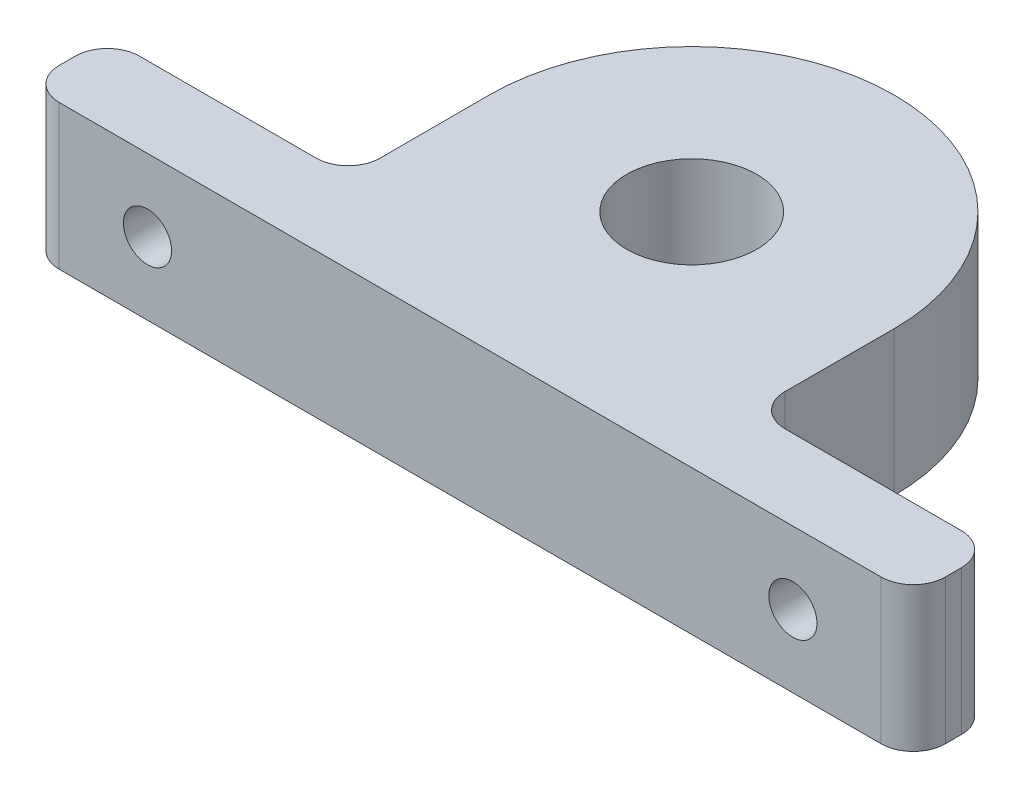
ISO-10303-21;
HEADER;
FILE_DESCRIPTION(('STEP AP214'),'2;1');
FILE_NAME('part.step','',(''),(''),'','','');
FILE_SCHEMA(('AUTOMOTIVE_DESIGN { 1 0 10303 214 1 1 1 1 }'));
ENDSEC;
DATA;
#1=APPLICATION_CONTEXT('core data for automotive mechanical design processes');
#2=APPLICATION_PROTOCOL_DEFINITION('international standard','automotive_design',2000,#1);
#3=PRODUCT_CONTEXT('',#1,'mechanical');
#4=PRODUCT('Part','Part','',(#3));
#5=PRODUCT_RELATED_PRODUCT_CATEGORY('part','',(#4));
#6=PRODUCT_DEFINITION_FORMATION('','',#4);
#7=PRODUCT_DEFINITION_CONTEXT('part definition',#1,'design');
#8=PRODUCT_DEFINITION('design','',#6,#7);
#9=PRODUCT_DEFINITION_SHAPE('','',#8);
#10=(LENGTH_UNIT() NAMED_UNIT(*) SI_UNIT(.MILLI.,.METRE.));
#11=(NAMED_UNIT(*) PLANE_ANGLE_UNIT() SI_UNIT($,.RADIAN.));
#12=(NAMED_UNIT(*) SI_UNIT($,.STERADIAN.) SOLID_ANGLE_UNIT());
#13=UNCERTAINTY_MEASURE_WITH_UNIT(LENGTH_MEASURE(1.E-05),#10,'distance_accuracy_value','');
#14=(GEOMETRIC_REPRESENTATION_CONTEXT(3) GLOBAL_UNCERTAINTY_ASSIGNED_CONTEXT((#13)) GLOBAL_UNIT_ASSIGNED_CONTEXT((#10,
#11,#12)) REPRESENTATION_CONTEXT('',''));
#15=CARTESIAN_POINT('',(0.,0.,0.));
#16=DIRECTION('',(0.,0.,1.));
#17=DIRECTION('',(1.,0.,0.));
#18=AXIS2_PLACEMENT_3D('',#15,#16,#17);
#19=CARTESIAN_POINT('',(-27.6,9.,0.));
#20=DIRECTION('',(-1.,0.,0.));
#21=DIRECTION('',(0.,0.,1.));
#22=AXIS2_PLACEMENT_3D('',#19,#20,#21);
#23=PLANE('',#22);
#24=DIRECTION('',(0.,0.,-1.));
#25=VECTOR('',#24,1.);
#26=CARTESIAN_POINT('',(-27.6,0.,0.));
#27=LINE('',#26,#25);
#28=CARTESIAN_POINT('',(-27.6,0.,11.8));
#29=VERTEX_POINT('',#28);
#30=CARTESIAN_POINT('',(-27.6,0.,10.8));
#31=VERTEX_POINT('',#30);
#32=EDGE_CURVE('E175',#29,#31,#27,.T.);
#33=ORIENTED_EDGE('',*,*,#32,.F.);
#34=DIRECTION('',(0.,-1.,0.));
#35=VECTOR('',#34,1.);
#36=CARTESIAN_POINT('',(-27.6,9.,11.8));
#37=LINE('',#36,#35);
#38=CARTESIAN_POINT('',(-27.6,9.,11.8));
#39=VERTEX_POINT('',#38);
#40=EDGE_CURVE('E227',#29,#39,#37,.F.);
#41=ORIENTED_EDGE('',*,*,#40,.T.);
#42=DIRECTION('',(0.,0.,-1.));
#43=VECTOR('',#42,1.);
#44=CARTESIAN_POINT('',(-27.6,9.,0.));
#45=LINE('',#44,#43);
#46=CARTESIAN_POINT('',(-27.6,9.,10.8));
#47=VERTEX_POINT('',#46);
#48=EDGE_CURVE('E262',#39,#47,#45,.T.);
#49=ORIENTED_EDGE('',*,*,#48,.T.);
#50=DIRECTION('',(0.,-1.,0.));
#51=VECTOR('',#50,1.);
#52=CARTESIAN_POINT('',(-27.6,9.,10.8));
#53=LINE('',#52,#51);
#54=EDGE_CURVE('E224',#47,#31,#53,.T.);
#55=ORIENTED_EDGE('',*,*,#54,.T.);
#56=EDGE_LOOP('',(#33,#41,#49,#55));
#57=FACE_BOUND('',#56,.T.);
#58=ADVANCED_FACE('F35',(#57),#23,.T.);
#59=CARTESIAN_POINT('',(0.,9.,13.8));
#60=DIRECTION('',(0.,0.,-1.));
#61=DIRECTION('',(-1.,0.,0.));
#62=AXIS2_PLACEMENT_3D('',#59,#60,#61);
#63=PLANE('',#62);
#64=CARTESIAN_POINT('',(20.1011886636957,4.5,13.8));
#65=DIRECTION('',(0.,0.,-1.));
#66=DIRECTION('',(-1.,0.,0.));
#67=AXIS2_PLACEMENT_3D('',#64,#65,#66);
#68=CIRCLE('',#67,1.5);
#69=CARTESIAN_POINT('',(18.6011886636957,4.5,13.8));
#70=VERTEX_POINT('',#69);
#71=EDGE_CURVE('E285',#70,#70,#68,.T.);
#72=ORIENTED_EDGE('',*,*,#71,.T.);
#73=EDGE_LOOP('',(#72));
#74=FACE_BOUND('',#73,.T.);
#75=CARTESIAN_POINT('',(-20.1011886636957,4.5,13.8));
#76=DIRECTION('',(0.,0.,-1.));
#77=DIRECTION('',(-1.,0.,0.));
#78=AXIS2_PLACEMENT_3D('',#75,#76,#77);
#79=CIRCLE('',#78,1.5);
#80=CARTESIAN_POINT('',(-21.6011886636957,4.5,13.8));
#81=VERTEX_POINT('',#80);
#82=EDGE_CURVE('E176',#81,#81,#79,.T.);
#83=ORIENTED_EDGE('',*,*,#82,.T.);
#84=EDGE_LOOP('',(#83));
#85=FACE_BOUND('',#84,.T.);
#86=DIRECTION('',(1.,0.,0.));
#87=VECTOR('',#86,1.);
#88=CARTESIAN_POINT('',(0.,0.,13.8));
#89=LINE('',#88,#87);
#90=CARTESIAN_POINT('',(-25.6,0.,13.8));
#91=VERTEX_POINT('',#90);
#92=CARTESIAN_POINT('',(25.6,0.,13.8));
#93=VERTEX_POINT('',#92);
#94=EDGE_CURVE('E179',#91,#93,#89,.T.);
#95=ORIENTED_EDGE('',*,*,#94,.T.);
#96=DIRECTION('',(0.,-1.,0.));
#97=VECTOR('',#96,1.);
#98=CARTESIAN_POINT('',(25.6,9.,13.8));
#99=LINE('',#98,#97);
#100=CARTESIAN_POINT('',(25.6,9.,13.8));
#101=VERTEX_POINT('',#100);
#102=EDGE_CURVE('E214',#93,#101,#99,.F.);
#103=ORIENTED_EDGE('',*,*,#102,.T.);
#104=DIRECTION('',(1.,0.,0.));
#105=VECTOR('',#104,1.);
#106=CARTESIAN_POINT('',(0.,9.,13.8));
#107=LINE('',#106,#105);
#108=CARTESIAN_POINT('',(-25.6,9.,13.8));
#109=VERTEX_POINT('',#108);
#110=EDGE_CURVE('E272',#109,#101,#107,.T.);
#111=ORIENTED_EDGE('',*,*,#110,.F.);
#112=DIRECTION('',(0.,-1.,0.));
#113=VECTOR('',#112,1.);
#114=CARTESIAN_POINT('',(-25.6,0.,13.8));
#115=LINE('',#114,#113);
#116=EDGE_CURVE('E211',#109,#91,#115,.T.);
#117=ORIENTED_EDGE('',*,*,#116,.T.);
#118=EDGE_LOOP('',(#95,#103,#111,#117));
#119=FACE_BOUND('',#118,.T.);
#120=ADVANCED_FACE('F270',(#74,#85,#119),#63,.F.);
#121=CARTESIAN_POINT('',(27.6,9.,0.));
#122=DIRECTION('',(-1.,0.,0.));
#123=DIRECTION('',(0.,0.,1.));
#124=AXIS2_PLACEMENT_3D('',#121,#122,#123);
#125=PLANE('',#124);
#126=DIRECTION('',(0.,0.,-1.));
#127=VECTOR('',#126,1.);
#128=CARTESIAN_POINT('',(27.6,9.,0.));
#129=LINE('',#128,#127);
#130=CARTESIAN_POINT('',(27.6,9.,11.8));
#131=VERTEX_POINT('',#130);
#132=CARTESIAN_POINT('',(27.6,9.,10.8));
#133=VERTEX_POINT('',#132);
#134=EDGE_CURVE('E165',#131,#133,#129,.T.);
#135=ORIENTED_EDGE('',*,*,#134,.F.);
#136=DIRECTION('',(0.,-1.,0.));
#137=VECTOR('',#136,1.);
#138=CARTESIAN_POINT('',(27.6,9.,11.8));
#139=LINE('',#138,#137);
#140=CARTESIAN_POINT('',(27.6,0.,11.8));
#141=VERTEX_POINT('',#140);
#142=EDGE_CURVE('E200',#131,#141,#139,.T.);
#143=ORIENTED_EDGE('',*,*,#142,.T.);
#144=DIRECTION('',(0.,0.,-1.));
#145=VECTOR('',#144,1.);
#146=CARTESIAN_POINT('',(27.6,0.,0.));
#147=LINE('',#146,#145);
#148=CARTESIAN_POINT('',(27.6,0.,10.8));
#149=VERTEX_POINT('',#148);
#150=EDGE_CURVE('E182',#141,#149,#147,.T.);
#151=ORIENTED_EDGE('',*,*,#150,.T.);
#152=DIRECTION('',(0.,-1.,0.));
#153=VECTOR('',#152,1.);
#154=CARTESIAN_POINT('',(27.6,9.,10.8));
#155=LINE('',#154,#153);
#156=EDGE_CURVE('E148',#149,#133,#155,.F.);
#157=ORIENTED_EDGE('',*,*,#156,.T.);
#158=EDGE_LOOP('',(#135,#143,#151,#157));
#159=FACE_BOUND('',#158,.T.);
#160=ADVANCED_FACE('F298',(#159),#125,.F.);
#161=CARTESIAN_POINT('',(0.,9.,8.80000000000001));
#162=DIRECTION('',(0.,0.,1.));
#163=DIRECTION('',(1.,0.,0.));
#164=AXIS2_PLACEMENT_3D('',#161,#162,#163);
#165=PLANE('',#164);
#166=CARTESIAN_POINT('',(20.1011886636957,4.5,8.80000000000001));
#167=DIRECTION('',(0.,0.,-1.));
#168=DIRECTION('',(1.,0.,0.));
#169=AXIS2_PLACEMENT_3D('',#166,#167,#168);
#170=CIRCLE('',#169,1.5);
#171=CARTESIAN_POINT('',(21.6011886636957,4.5,8.80000000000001));
#172=VERTEX_POINT('',#171);
#173=EDGE_CURVE('E288',#172,#172,#170,.T.);
#174=ORIENTED_EDGE('',*,*,#173,.F.);
#175=EDGE_LOOP('',(#174));
#176=FACE_BOUND('',#175,.T.);
#177=DIRECTION('',(-1.,0.,0.));
#178=VECTOR('',#177,1.);
#179=CARTESIAN_POINT('',(0.,9.,8.80000000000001));
#180=LINE('',#179,#178);
#181=CARTESIAN_POINT('',(25.6,9.,8.8));
#182=VERTEX_POINT('',#181);
#183=CARTESIAN_POINT('',(14.6023773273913,9.,8.80000000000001));
#184=VERTEX_POINT('',#183);
#185=EDGE_CURVE('E163',#182,#184,#180,.T.);
#186=ORIENTED_EDGE('',*,*,#185,.F.);
#187=DIRECTION('',(0.,-1.,0.));
#188=VECTOR('',#187,1.);
#189=CARTESIAN_POINT('',(25.6,9.,8.8));
#190=LINE('',#189,#188);
#191=CARTESIAN_POINT('',(25.6,0.,8.8));
#192=VERTEX_POINT('',#191);
#193=EDGE_CURVE('E235',#182,#192,#190,.T.);
#194=ORIENTED_EDGE('',*,*,#193,.T.);
#195=DIRECTION('',(-1.,0.,0.));
#196=VECTOR('',#195,1.);
#197=CARTESIAN_POINT('',(0.,0.,8.80000000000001));
#198=LINE('',#197,#196);
#199=CARTESIAN_POINT('',(14.6023773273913,0.,8.80000000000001));
#200=VERTEX_POINT('',#199);
#201=EDGE_CURVE('E185',#192,#200,#198,.T.);
#202=ORIENTED_EDGE('',*,*,#201,.T.);
#203=DIRECTION('',(0.,-1.,0.));
#204=VECTOR('',#203,1.);
#205=CARTESIAN_POINT('',(14.6023773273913,9.,8.80000000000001));
#206=LINE('',#205,#204);
#207=EDGE_CURVE('E233',#200,#184,#206,.F.);
#208=ORIENTED_EDGE('',*,*,#207,.T.);
#209=EDGE_LOOP('',(#186,#194,#202,#208));
#210=FACE_BOUND('',#209,.T.);
#211=ADVANCED_FACE('F295',(#176,#210),#165,.F.);
#212=CARTESIAN_POINT('',(12.6104362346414,9.,0.0149806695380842));
#213=DIRECTION('',(0.999999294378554,0.,0.00118795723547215));
#214=DIRECTION('',(0.00118795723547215,0.,-0.999999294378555));
#215=AXIS2_PLACEMENT_3D('',#212,#213,#214);
#216=PLANE('',#215);
#217=DIRECTION('',(-0.00118795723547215,0.,0.999999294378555));
#218=VECTOR('',#217,1.);
#219=CARTESIAN_POINT('',(12.6104362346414,9.,0.0149806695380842));
#220=LINE('',#219,#218);
#221=CARTESIAN_POINT('',(12.6104540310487,9.,0.));
#222=VERTEX_POINT('',#221);
#223=CARTESIAN_POINT('',(12.6023787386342,9.,6.79762408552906));
#224=VERTEX_POINT('',#223);
#225=EDGE_CURVE('E141',#222,#224,#220,.T.);
#226=ORIENTED_EDGE('',*,*,#225,.T.);
#227=DIRECTION('',(0.,-1.,0.));
#228=VECTOR('',#227,1.);
#229=CARTESIAN_POINT('',(12.6023787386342,9.,6.79762408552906));
#230=LINE('',#229,#228);
#231=CARTESIAN_POINT('',(12.6023787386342,0.,6.79762408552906));
#232=VERTEX_POINT('',#231);
#233=EDGE_CURVE('E238',#224,#232,#230,.T.);
#234=ORIENTED_EDGE('',*,*,#233,.T.);
#235=DIRECTION('',(-0.00118795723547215,0.,0.999999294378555));
#236=VECTOR('',#235,1.);
#237=CARTESIAN_POINT('',(12.6104362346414,0.,0.0149806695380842));
#238=LINE('',#237,#236);
#239=CARTESIAN_POINT('',(12.6104540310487,0.,0.));
#240=VERTEX_POINT('',#239);
#241=EDGE_CURVE('E144',#240,#232,#238,.T.);
#242=ORIENTED_EDGE('',*,*,#241,.F.);
#243=DIRECTION('',(0.,-1.,0.));
#244=VECTOR('',#243,1.);
#245=CARTESIAN_POINT('',(12.6104540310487,9.,0.));
#246=LINE('',#245,#244);
#247=EDGE_CURVE('E136',#222,#240,#246,.T.);
#248=ORIENTED_EDGE('',*,*,#247,.F.);
#249=EDGE_LOOP('',(#226,#234,#242,#248));
#250=FACE_BOUND('',#249,.T.);
#251=ADVANCED_FACE('F138',(#250),#216,.T.);
#252=CARTESIAN_POINT('',(0.,9.,0.));
#253=DIRECTION('',(0.,-1.,0.));
#254=DIRECTION('',(0.,0.,-1.));
#255=AXIS2_PLACEMENT_3D('',#252,#253,#254);
#256=CYLINDRICAL_SURFACE('',#255,12.6104540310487);
#257=CARTESIAN_POINT('',(0.,0.,0.));
#258=DIRECTION('',(0.,1.,0.));
#259=DIRECTION('',(0.,0.,1.));
#260=AXIS2_PLACEMENT_3D('',#257,#258,#259);
#261=CIRCLE('',#260,12.6104540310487);
#262=CARTESIAN_POINT('',(-12.6104540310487,0.,0.));
#263=VERTEX_POINT('',#262);
#264=EDGE_CURVE('E189',#240,#263,#261,.T.);
#265=ORIENTED_EDGE('',*,*,#264,.T.);
#266=DIRECTION('',(0.,-1.,0.));
#267=VECTOR('',#266,1.);
#268=CARTESIAN_POINT('',(-12.6104540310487,9.,0.));
#269=LINE('',#268,#267);
#270=CARTESIAN_POINT('',(-12.6104540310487,9.,0.));
#271=VERTEX_POINT('',#270);
#272=EDGE_CURVE('E149',#271,#263,#269,.T.);
#273=ORIENTED_EDGE('',*,*,#272,.F.);
#274=CARTESIAN_POINT('',(0.,9.,0.));
#275=DIRECTION('',(0.,1.,0.));
#276=DIRECTION('',(0.,0.,1.));
#277=AXIS2_PLACEMENT_3D('',#274,#275,#276);
#278=CIRCLE('',#277,12.6104540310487);
#279=EDGE_CURVE('E153',#222,#271,#278,.T.);
#280=ORIENTED_EDGE('',*,*,#279,.F.);
#281=ORIENTED_EDGE('',*,*,#247,.T.);
#282=EDGE_LOOP('',(#265,#273,#280,#281));
#283=FACE_BOUND('',#282,.T.);
#284=ADVANCED_FACE('F154',(#283),#256,.T.);
#285=CARTESIAN_POINT('',(-12.6104362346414,9.,0.0149806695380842));
#286=DIRECTION('',(0.999999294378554,0.,-0.00118795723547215));
#287=DIRECTION('',(-0.00118795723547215,0.,-0.999999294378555));
#288=AXIS2_PLACEMENT_3D('',#285,#286,#287);
#289=PLANE('',#288);
#290=DIRECTION('',(0.00118795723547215,0.,0.999999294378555));
#291=VECTOR('',#290,1.);
#292=CARTESIAN_POINT('',(-12.6104362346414,0.,0.0149806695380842));
#293=LINE('',#292,#291);
#294=CARTESIAN_POINT('',(-12.6023787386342,0.,6.79762408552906));
#295=VERTEX_POINT('',#294);
#296=EDGE_CURVE('E191',#263,#295,#293,.T.);
#297=ORIENTED_EDGE('',*,*,#296,.T.);
#298=DIRECTION('',(0.,-1.,0.));
#299=VECTOR('',#298,1.);
#300=CARTESIAN_POINT('',(-12.6023787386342,9.,6.79762408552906));
#301=LINE('',#300,#299);
#302=CARTESIAN_POINT('',(-12.6023787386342,9.,6.79762408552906));
#303=VERTEX_POINT('',#302);
#304=EDGE_CURVE('E240',#295,#303,#301,.F.);
#305=ORIENTED_EDGE('',*,*,#304,.T.);
#306=DIRECTION('',(0.00118795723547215,0.,0.999999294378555));
#307=VECTOR('',#306,1.);
#308=CARTESIAN_POINT('',(-12.6104362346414,9.,0.0149806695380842));
#309=LINE('',#308,#307);
#310=EDGE_CURVE('E156',#271,#303,#309,.T.);
#311=ORIENTED_EDGE('',*,*,#310,.F.);
#312=ORIENTED_EDGE('',*,*,#272,.T.);
#313=EDGE_LOOP('',(#297,#305,#311,#312));
#314=FACE_BOUND('',#313,.T.);
#315=ADVANCED_FACE('F251',(#314),#289,.F.);
#316=CARTESIAN_POINT('',(0.,9.,0.));
#317=DIRECTION('',(0.,-1.,0.));
#318=DIRECTION('',(0.,0.,-1.));
#319=AXIS2_PLACEMENT_3D('',#316,#317,#318);
#320=CYLINDRICAL_SURFACE('',#319,4.05);
#321=CARTESIAN_POINT('',(0.,9.,0.));
#322=DIRECTION('',(0.,1.,0.));
#323=DIRECTION('',(0.,0.,1.));
#324=AXIS2_PLACEMENT_3D('',#321,#322,#323);
#325=CIRCLE('',#324,4.05);
#326=CARTESIAN_POINT('',(0.,9.,4.05));
#327=VERTEX_POINT('',#326);
#328=EDGE_CURVE('E197',#327,#327,#325,.T.);
#329=ORIENTED_EDGE('',*,*,#328,.T.);
#330=EDGE_LOOP('',(#329));
#331=FACE_BOUND('',#330,.T.);
#332=CARTESIAN_POINT('',(0.,0.,0.));
#333=DIRECTION('',(0.,1.,0.));
#334=DIRECTION('',(0.,0.,1.));
#335=AXIS2_PLACEMENT_3D('',#332,#333,#334);
#336=CIRCLE('',#335,4.05);
#337=CARTESIAN_POINT('',(0.,0.,4.05));
#338=VERTEX_POINT('',#337);
#339=EDGE_CURVE('E172',#338,#338,#336,.T.);
#340=ORIENTED_EDGE('',*,*,#339,.F.);
#341=EDGE_LOOP('',(#340));
#342=FACE_BOUND('',#341,.T.);
#343=ADVANCED_FACE('F332',(#331,#342),#320,.F.);
#344=CARTESIAN_POINT('',(0.,9.,8.80000000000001));
#345=DIRECTION('',(0.,0.,-1.));
#346=DIRECTION('',(-1.,0.,0.));
#347=AXIS2_PLACEMENT_3D('',#344,#345,#346);
#348=PLANE('',#347);
#349=CARTESIAN_POINT('',(-20.1011886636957,4.5,8.8));
#350=DIRECTION('',(0.,0.,-1.));
#351=DIRECTION('',(-1.,0.,0.));
#352=AXIS2_PLACEMENT_3D('',#349,#350,#351);
#353=CIRCLE('',#352,1.5);
#354=CARTESIAN_POINT('',(-21.6011886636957,4.5,8.8));
#355=VERTEX_POINT('',#354);
#356=EDGE_CURVE('E282',#355,#355,#353,.T.);
#357=ORIENTED_EDGE('',*,*,#356,.F.);
#358=EDGE_LOOP('',(#357));
#359=FACE_BOUND('',#358,.T.);
#360=DIRECTION('',(1.,0.,0.));
#361=VECTOR('',#360,1.);
#362=CARTESIAN_POINT('',(0.,0.,8.80000000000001));
#363=LINE('',#362,#361);
#364=CARTESIAN_POINT('',(-25.6,0.,8.8));
#365=VERTEX_POINT('',#364);
#366=CARTESIAN_POINT('',(-14.6023773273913,0.,8.80000000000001));
#367=VERTEX_POINT('',#366);
#368=EDGE_CURVE('E194',#365,#367,#363,.T.);
#369=ORIENTED_EDGE('',*,*,#368,.F.);
#370=DIRECTION('',(0.,-1.,0.));
#371=VECTOR('',#370,1.);
#372=CARTESIAN_POINT('',(-25.6,9.,8.8));
#373=LINE('',#372,#371);
#374=CARTESIAN_POINT('',(-25.6,9.,8.8));
#375=VERTEX_POINT('',#374);
#376=EDGE_CURVE('E55',#365,#375,#373,.F.);
#377=ORIENTED_EDGE('',*,*,#376,.T.);
#378=DIRECTION('',(1.,0.,0.));
#379=VECTOR('',#378,1.);
#380=CARTESIAN_POINT('',(0.,9.,8.80000000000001));
#381=LINE('',#380,#379);
#382=CARTESIAN_POINT('',(-14.6023773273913,9.,8.80000000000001));
#383=VERTEX_POINT('',#382);
#384=EDGE_CURVE('E170',#375,#383,#381,.T.);
#385=ORIENTED_EDGE('',*,*,#384,.T.);
#386=DIRECTION('',(0.,-1.,0.));
#387=VECTOR('',#386,1.);
#388=CARTESIAN_POINT('',(-14.6023773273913,9.,8.80000000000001));
#389=LINE('',#388,#387);
#390=EDGE_CURVE('E229',#383,#367,#389,.T.);
#391=ORIENTED_EDGE('',*,*,#390,.T.);
#392=EDGE_LOOP('',(#369,#377,#385,#391));
#393=FACE_BOUND('',#392,.T.);
#394=ADVANCED_FACE('F252',(#359,#393),#348,.T.);
#395=CARTESIAN_POINT('',(0.,9.,0.));
#396=DIRECTION('',(0.,1.,0.));
#397=DIRECTION('',(0.,0.,1.));
#398=AXIS2_PLACEMENT_3D('',#395,#396,#397);
#399=PLANE('',#398);
#400=ORIENTED_EDGE('',*,*,#328,.F.);
#401=EDGE_LOOP('',(#400));
#402=FACE_BOUND('',#401,.T.);
#403=ORIENTED_EDGE('',*,*,#110,.T.);
#404=CARTESIAN_POINT('',(25.6,9.,11.8));
#405=DIRECTION('',(0.,1.,0.));
#406=DIRECTION('',(0.,0.,1.));
#407=AXIS2_PLACEMENT_3D('',#404,#405,#406);
#408=CIRCLE('',#407,2.);
#409=EDGE_CURVE('E222',#101,#131,#408,.T.);
#410=ORIENTED_EDGE('',*,*,#409,.T.);
#411=ORIENTED_EDGE('',*,*,#134,.T.);
#412=CARTESIAN_POINT('',(25.6,9.,10.8));
#413=DIRECTION('',(0.,1.,0.));
#414=DIRECTION('',(0.,0.,1.));
#415=AXIS2_PLACEMENT_3D('',#412,#413,#414);
#416=CIRCLE('',#415,2.);
#417=EDGE_CURVE('E216',#133,#182,#416,.T.);
#418=ORIENTED_EDGE('',*,*,#417,.T.);
#419=ORIENTED_EDGE('',*,*,#185,.T.);
#420=CARTESIAN_POINT('',(14.6023773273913,9.,6.80000000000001));
#421=DIRECTION('',(0.,1.,0.));
#422=DIRECTION('',(0.,0.,1.));
#423=AXIS2_PLACEMENT_3D('',#420,#421,#422);
#424=CIRCLE('',#423,2.);
#425=EDGE_CURVE('E162',#184,#224,#424,.F.);
#426=ORIENTED_EDGE('',*,*,#425,.T.);
#427=ORIENTED_EDGE('',*,*,#225,.F.);
#428=ORIENTED_EDGE('',*,*,#279,.T.);
#429=ORIENTED_EDGE('',*,*,#310,.T.);
#430=CARTESIAN_POINT('',(-14.6023773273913,9.,6.80000000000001));
#431=DIRECTION('',(0.,1.,0.));
#432=DIRECTION('',(0.,0.,1.));
#433=AXIS2_PLACEMENT_3D('',#430,#431,#432);
#434=CIRCLE('',#433,2.);
#435=EDGE_CURVE('E11',#303,#383,#434,.F.);
#436=ORIENTED_EDGE('',*,*,#435,.T.);
#437=ORIENTED_EDGE('',*,*,#384,.F.);
#438=CARTESIAN_POINT('',(-25.6,9.,10.8));
#439=DIRECTION('',(0.,1.,0.));
#440=DIRECTION('',(0.,0.,1.));
#441=AXIS2_PLACEMENT_3D('',#438,#439,#440);
#442=CIRCLE('',#441,2.);
#443=EDGE_CURVE('E218',#375,#47,#442,.T.);
#444=ORIENTED_EDGE('',*,*,#443,.T.);
#445=ORIENTED_EDGE('',*,*,#48,.F.);
#446=CARTESIAN_POINT('',(-25.6,9.,11.8));
#447=DIRECTION('',(0.,1.,0.));
#448=DIRECTION('',(0.,0.,1.));
#449=AXIS2_PLACEMENT_3D('',#446,#447,#448);
#450=CIRCLE('',#449,2.);
#451=EDGE_CURVE('E220',#39,#109,#450,.T.);
#452=ORIENTED_EDGE('',*,*,#451,.T.);
#453=EDGE_LOOP('',(#403,#410,#411,#418,#419,#426,#427,#428,#429,#436,#437,#444,#445,#452));
#454=FACE_BOUND('',#453,.T.);
#455=ADVANCED_FACE('F159',(#402,#454),#399,.T.);
#456=CARTESIAN_POINT('',(0.,0.,0.));
#457=DIRECTION('',(0.,1.,0.));
#458=DIRECTION('',(0.,0.,1.));
#459=AXIS2_PLACEMENT_3D('',#456,#457,#458);
#460=PLANE('',#459);
#461=ORIENTED_EDGE('',*,*,#339,.T.);
#462=EDGE_LOOP('',(#461));
#463=FACE_BOUND('',#462,.T.);
#464=ORIENTED_EDGE('',*,*,#150,.F.);
#465=CARTESIAN_POINT('',(25.6,0.,11.8));
#466=DIRECTION('',(0.,1.,0.));
#467=DIRECTION('',(0.,0.,1.));
#468=AXIS2_PLACEMENT_3D('',#465,#466,#467);
#469=CIRCLE('',#468,2.);
#470=EDGE_CURVE('E209',#141,#93,#469,.F.);
#471=ORIENTED_EDGE('',*,*,#470,.T.);
#472=ORIENTED_EDGE('',*,*,#94,.F.);
#473=CARTESIAN_POINT('',(-25.6,0.,11.8));
#474=DIRECTION('',(0.,1.,0.));
#475=DIRECTION('',(0.,0.,1.));
#476=AXIS2_PLACEMENT_3D('',#473,#474,#475);
#477=CIRCLE('',#476,2.);
#478=EDGE_CURVE('E207',#91,#29,#477,.F.);
#479=ORIENTED_EDGE('',*,*,#478,.T.);
#480=ORIENTED_EDGE('',*,*,#32,.T.);
#481=CARTESIAN_POINT('',(-25.6,0.,10.8));
#482=DIRECTION('',(0.,1.,0.));
#483=DIRECTION('',(0.,0.,1.));
#484=AXIS2_PLACEMENT_3D('',#481,#482,#483);
#485=CIRCLE('',#484,2.);
#486=EDGE_CURVE('E205',#31,#365,#485,.F.);
#487=ORIENTED_EDGE('',*,*,#486,.T.);
#488=ORIENTED_EDGE('',*,*,#368,.T.);
#489=CARTESIAN_POINT('',(-14.6023773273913,0.,6.80000000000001));
#490=DIRECTION('',(0.,1.,0.));
#491=DIRECTION('',(0.,0.,1.));
#492=AXIS2_PLACEMENT_3D('',#489,#490,#491);
#493=CIRCLE('',#492,2.);
#494=EDGE_CURVE('E43',#367,#295,#493,.T.);
#495=ORIENTED_EDGE('',*,*,#494,.T.);
#496=ORIENTED_EDGE('',*,*,#296,.F.);
#497=ORIENTED_EDGE('',*,*,#264,.F.);
#498=ORIENTED_EDGE('',*,*,#241,.T.);
#499=CARTESIAN_POINT('',(14.6023773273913,0.,6.80000000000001));
#500=DIRECTION('',(0.,1.,0.));
#501=DIRECTION('',(0.,0.,1.));
#502=AXIS2_PLACEMENT_3D('',#499,#500,#501);
#503=CIRCLE('',#502,2.);
#504=EDGE_CURVE('E242',#232,#200,#503,.T.);
#505=ORIENTED_EDGE('',*,*,#504,.T.);
#506=ORIENTED_EDGE('',*,*,#201,.F.);
#507=CARTESIAN_POINT('',(25.6,0.,10.8));
#508=DIRECTION('',(0.,1.,0.));
#509=DIRECTION('',(0.,0.,1.));
#510=AXIS2_PLACEMENT_3D('',#507,#508,#509);
#511=CIRCLE('',#510,2.);
#512=EDGE_CURVE('E203',#192,#149,#511,.F.);
#513=ORIENTED_EDGE('',*,*,#512,.T.);
#514=EDGE_LOOP('',(#464,#471,#472,#479,#480,#487,#488,#495,#496,#497,#498,#505,#506,#513));
#515=FACE_BOUND('',#514,.T.);
#516=ADVANCED_FACE('F246',(#463,#515),#460,.F.);
#517=CARTESIAN_POINT('',(25.6,9.,11.8));
#518=DIRECTION('',(0.,-1.,0.));
#519=DIRECTION('',(0.,0.,-1.));
#520=AXIS2_PLACEMENT_3D('',#517,#518,#519);
#521=CYLINDRICAL_SURFACE('',#520,2.);
#522=ORIENTED_EDGE('',*,*,#409,.F.);
#523=ORIENTED_EDGE('',*,*,#102,.F.);
#524=ORIENTED_EDGE('',*,*,#470,.F.);
#525=ORIENTED_EDGE('',*,*,#142,.F.);
#526=EDGE_LOOP('',(#522,#523,#524,#525));
#527=FACE_BOUND('',#526,.T.);
#528=ADVANCED_FACE('F312',(#527),#521,.T.);
#529=CARTESIAN_POINT('',(-25.6,9.,11.8));
#530=DIRECTION('',(0.,1.,0.));
#531=DIRECTION('',(0.,0.,1.));
#532=AXIS2_PLACEMENT_3D('',#529,#530,#531);
#533=CYLINDRICAL_SURFACE('',#532,2.);
#534=ORIENTED_EDGE('',*,*,#451,.F.);
#535=ORIENTED_EDGE('',*,*,#40,.F.);
#536=ORIENTED_EDGE('',*,*,#478,.F.);
#537=ORIENTED_EDGE('',*,*,#116,.F.);
#538=EDGE_LOOP('',(#534,#535,#536,#537));
#539=FACE_BOUND('',#538,.T.);
#540=ADVANCED_FACE('F267',(#539),#533,.T.);
#541=CARTESIAN_POINT('',(-25.6,9.,10.8));
#542=DIRECTION('',(0.,-1.,0.));
#543=DIRECTION('',(0.,0.,-1.));
#544=AXIS2_PLACEMENT_3D('',#541,#542,#543);
#545=CYLINDRICAL_SURFACE('',#544,2.);
#546=ORIENTED_EDGE('',*,*,#443,.F.);
#547=ORIENTED_EDGE('',*,*,#376,.F.);
#548=ORIENTED_EDGE('',*,*,#486,.F.);
#549=ORIENTED_EDGE('',*,*,#54,.F.);
#550=EDGE_LOOP('',(#546,#547,#548,#549));
#551=FACE_BOUND('',#550,.T.);
#552=ADVANCED_FACE('F258',(#551),#545,.T.);
#553=CARTESIAN_POINT('',(25.6,9.,10.8));
#554=DIRECTION('',(0.,-1.,0.));
#555=DIRECTION('',(0.,0.,-1.));
#556=AXIS2_PLACEMENT_3D('',#553,#554,#555);
#557=CYLINDRICAL_SURFACE('',#556,2.);
#558=ORIENTED_EDGE('',*,*,#417,.F.);
#559=ORIENTED_EDGE('',*,*,#156,.F.);
#560=ORIENTED_EDGE('',*,*,#512,.F.);
#561=ORIENTED_EDGE('',*,*,#193,.F.);
#562=EDGE_LOOP('',(#558,#559,#560,#561));
#563=FACE_BOUND('',#562,.T.);
#564=ADVANCED_FACE('F306',(#563),#557,.T.);
#565=CARTESIAN_POINT('',(14.6023773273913,9.,6.80000000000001));
#566=DIRECTION('',(0.,-1.,0.));
#567=DIRECTION('',(0.,0.,-1.));
#568=AXIS2_PLACEMENT_3D('',#565,#566,#567);
#569=CYLINDRICAL_SURFACE('',#568,2.);
#570=ORIENTED_EDGE('',*,*,#425,.F.);
#571=ORIENTED_EDGE('',*,*,#207,.F.);
#572=ORIENTED_EDGE('',*,*,#504,.F.);
#573=ORIENTED_EDGE('',*,*,#233,.F.);
#574=EDGE_LOOP('',(#570,#571,#572,#573));
#575=FACE_BOUND('',#574,.T.);
#576=ADVANCED_FACE('F421',(#575),#569,.F.);
#577=CARTESIAN_POINT('',(-14.6023773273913,9.,6.80000000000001));
#578=DIRECTION('',(0.,-1.,0.));
#579=DIRECTION('',(0.,0.,-1.));
#580=AXIS2_PLACEMENT_3D('',#577,#578,#579);
#581=CYLINDRICAL_SURFACE('',#580,2.);
#582=ORIENTED_EDGE('',*,*,#435,.F.);
#583=ORIENTED_EDGE('',*,*,#304,.F.);
#584=ORIENTED_EDGE('',*,*,#494,.F.);
#585=ORIENTED_EDGE('',*,*,#390,.F.);
#586=EDGE_LOOP('',(#582,#583,#584,#585));
#587=FACE_BOUND('',#586,.T.);
#588=ADVANCED_FACE('F37',(#587),#581,.F.);
#589=CARTESIAN_POINT('',(-20.1011886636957,4.5,18.8));
#590=DIRECTION('',(0.,0.,-1.));
#591=DIRECTION('',(-1.,0.,0.));
#592=AXIS2_PLACEMENT_3D('',#589,#590,#591);
#593=CYLINDRICAL_SURFACE('',#592,1.5);
#594=ORIENTED_EDGE('',*,*,#356,.T.);
#595=EDGE_LOOP('',(#594));
#596=FACE_BOUND('',#595,.T.);
#597=ORIENTED_EDGE('',*,*,#82,.F.);
#598=EDGE_LOOP('',(#597));
#599=FACE_BOUND('',#598,.T.);
#600=ADVANCED_FACE('F352',(#596,#599),#593,.F.);
#601=CARTESIAN_POINT('',(20.1011886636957,4.5,18.8));
#602=DIRECTION('',(0.,0.,-1.));
#603=DIRECTION('',(-1.,0.,0.));
#604=AXIS2_PLACEMENT_3D('',#601,#602,#603);
#605=CYLINDRICAL_SURFACE('',#604,1.5);
#606=ORIENTED_EDGE('',*,*,#173,.T.);
#607=EDGE_LOOP('',(#606));
#608=FACE_BOUND('',#607,.T.);
#609=ORIENTED_EDGE('',*,*,#71,.F.);
#610=EDGE_LOOP('',(#609));
#611=FACE_BOUND('',#610,.T.);
#612=ADVANCED_FACE('F292',(#608,#611),#605,.F.);
#613=CLOSED_SHELL('',(#58,#120,#160,#211,#251,#284,#315,#343,#394,#455,#516,#528,#540,#552,#564,
#576,#588,#600,#612));
#614=MANIFOLD_SOLID_BREP('B2',#613);
#615=ADVANCED_BREP_SHAPE_REPRESENTATION('',(#18,#614),#14);
#616=SHAPE_DEFINITION_REPRESENTATION(#9,#615);
ENDSEC;
END-ISO-10303-21;
